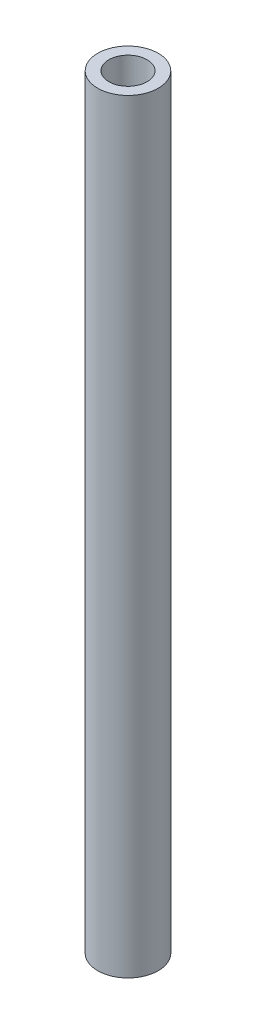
from build123d import *

# Parameters (mm, degrees)
CROQUIS1_R              = 1.585
CROQUIS1_R_2            = 1
SALIENTE_EXTRUIR1_DEPTH = 40


with BuildPart() as part:
    # Croquis1 → Saliente-Extruir1 (new body)
    with BuildSketch(Plane(origin=(0, 0, 0), x_dir=(1, 0, 0), z_dir=(0, 1, 0))):
        with Locations(Location((0, 0, 0), (0, 0, 270))):
            Circle(CROQUIS1_R)
        with Locations(Location((0, 0, 0), (0, 0, 270))):
            Circle(CROQUIS1_R_2, mode=Mode.SUBTRACT)
    extrude(amount=SALIENTE_EXTRUIR1_DEPTH)


solid = part.part
